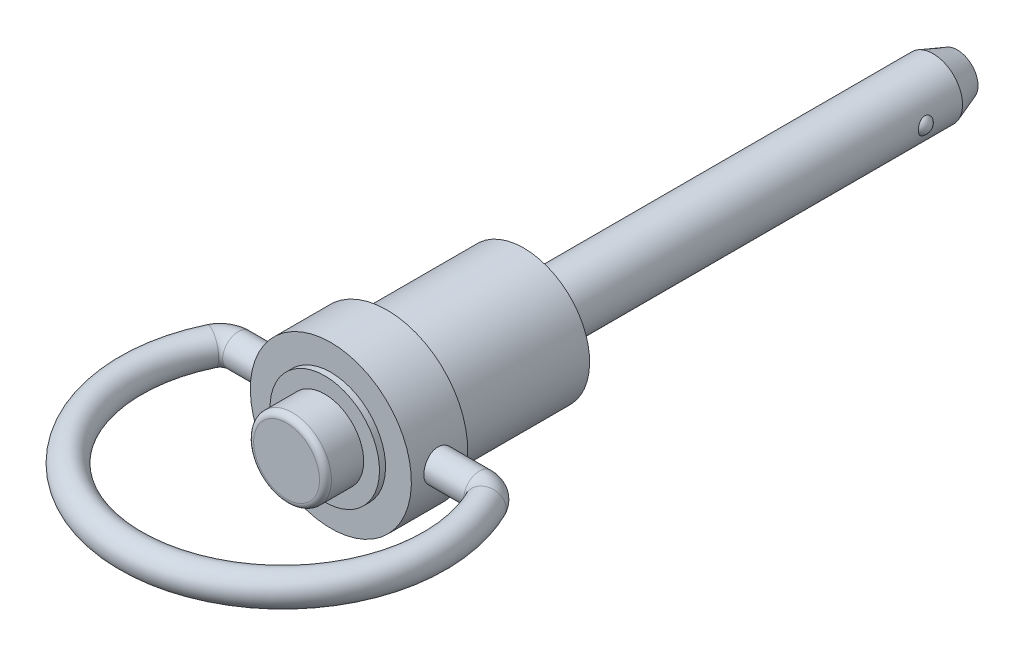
ISO-10303-21;
HEADER;
FILE_DESCRIPTION(('STEP AP214'),'2;1');
FILE_NAME('part.step','',(''),(''),'','','');
FILE_SCHEMA(('AUTOMOTIVE_DESIGN { 1 0 10303 214 1 1 1 1 }'));
ENDSEC;
DATA;
#1=APPLICATION_CONTEXT('core data for automotive mechanical design processes');
#2=APPLICATION_PROTOCOL_DEFINITION('international standard','automotive_design',2000,#1);
#3=PRODUCT_CONTEXT('',#1,'mechanical');
#4=PRODUCT('Part','Part','',(#3));
#5=PRODUCT_RELATED_PRODUCT_CATEGORY('part','',(#4));
#6=PRODUCT_DEFINITION_FORMATION('','',#4);
#7=PRODUCT_DEFINITION_CONTEXT('part definition',#1,'design');
#8=PRODUCT_DEFINITION('design','',#6,#7);
#9=PRODUCT_DEFINITION_SHAPE('','',#8);
#10=(LENGTH_UNIT() NAMED_UNIT(*) SI_UNIT(.MILLI.,.METRE.));
#11=(NAMED_UNIT(*) PLANE_ANGLE_UNIT() SI_UNIT($,.RADIAN.));
#12=(NAMED_UNIT(*) SI_UNIT($,.STERADIAN.) SOLID_ANGLE_UNIT());
#13=UNCERTAINTY_MEASURE_WITH_UNIT(LENGTH_MEASURE(1.E-05),#10,'distance_accuracy_value','');
#14=(GEOMETRIC_REPRESENTATION_CONTEXT(3) GLOBAL_UNCERTAINTY_ASSIGNED_CONTEXT((#13)) GLOBAL_UNIT_ASSIGNED_CONTEXT((#10,
#11,#12)) REPRESENTATION_CONTEXT('',''));
#15=CARTESIAN_POINT('',(0.,0.,0.));
#16=DIRECTION('',(0.,0.,1.));
#17=DIRECTION('',(1.,0.,0.));
#18=AXIS2_PLACEMENT_3D('',#15,#16,#17);
#19=CARTESIAN_POINT('',(0.,0.,20.828));
#20=DIRECTION('',(0.,0.,-1.));
#21=DIRECTION('',(0.,1.,0.));
#22=AXIS2_PLACEMENT_3D('',#19,#20,#21);
#23=CYLINDRICAL_SURFACE('',#22,3.2512);
#24=CARTESIAN_POINT('',(0.,0.,16.637));
#25=DIRECTION('',(0.,0.,-1.));
#26=DIRECTION('',(0.,1.,0.));
#27=AXIS2_PLACEMENT_3D('',#24,#25,#26);
#28=CIRCLE('',#27,3.2512);
#29=CARTESIAN_POINT('',(0.,3.2512,16.637));
#30=VERTEX_POINT('',#29);
#31=EDGE_CURVE('E35',#30,#30,#28,.T.);
#32=ORIENTED_EDGE('',*,*,#31,.F.);
#33=EDGE_LOOP('',(#32));
#34=FACE_BOUND('',#33,.T.);
#35=CARTESIAN_POINT('',(0.,0.,19.328));
#36=DIRECTION('',(0.,0.,1.));
#37=DIRECTION('',(1.,0.,0.));
#38=AXIS2_PLACEMENT_3D('',#35,#36,#37);
#39=CIRCLE('',#38,3.2512);
#40=CARTESIAN_POINT('',(3.2512,0.,19.328));
#41=VERTEX_POINT('',#40);
#42=EDGE_CURVE('E157',#41,#41,#39,.T.);
#43=ORIENTED_EDGE('',*,*,#42,.F.);
#44=EDGE_LOOP('',(#43));
#45=FACE_BOUND('',#44,.T.);
#46=ADVANCED_FACE('F13',(#34,#45),#23,.T.);
#47=CARTESIAN_POINT('',(4.572,0.,16.637));
#48=DIRECTION('',(0.,0.,1.));
#49=DIRECTION('',(0.,-1.,0.));
#50=AXIS2_PLACEMENT_3D('',#47,#48,#49);
#51=PLANE('',#50);
#52=ORIENTED_EDGE('',*,*,#31,.T.);
#53=EDGE_LOOP('',(#52));
#54=FACE_BOUND('',#53,.T.);
#55=CARTESIAN_POINT('',(0.,0.,16.637));
#56=DIRECTION('',(0.,0.,-1.));
#57=DIRECTION('',(0.,1.,0.));
#58=AXIS2_PLACEMENT_3D('',#55,#56,#57);
#59=CIRCLE('',#58,4.572);
#60=CARTESIAN_POINT('',(0.,4.572,16.637));
#61=VERTEX_POINT('',#60);
#62=EDGE_CURVE('E40',#61,#61,#59,.T.);
#63=ORIENTED_EDGE('',*,*,#62,.F.);
#64=EDGE_LOOP('',(#63));
#65=FACE_BOUND('',#64,.T.);
#66=ADVANCED_FACE('F81',(#54,#65),#51,.T.);
#67=CARTESIAN_POINT('',(0.,0.,0.));
#68=DIRECTION('',(0.,0.,-1.));
#69=DIRECTION('',(0.,1.,0.));
#70=AXIS2_PLACEMENT_3D('',#67,#68,#69);
#71=CYLINDRICAL_SURFACE('',#70,4.572);
#72=ORIENTED_EDGE('',*,*,#62,.T.);
#73=EDGE_LOOP('',(#72));
#74=FACE_BOUND('',#73,.T.);
#75=CARTESIAN_POINT('',(0.,0.,16.129));
#76=DIRECTION('',(0.,0.,-1.));
#77=DIRECTION('',(0.,1.,0.));
#78=AXIS2_PLACEMENT_3D('',#75,#76,#77);
#79=CIRCLE('',#78,4.572);
#80=CARTESIAN_POINT('',(0.,4.572,16.129));
#81=VERTEX_POINT('',#80);
#82=EDGE_CURVE('E43',#81,#81,#79,.T.);
#83=ORIENTED_EDGE('',*,*,#82,.F.);
#84=EDGE_LOOP('',(#83));
#85=FACE_BOUND('',#84,.T.);
#86=ADVANCED_FACE('F151',(#74,#85),#71,.T.);
#87=CARTESIAN_POINT('',(6.731,0.,16.129));
#88=DIRECTION('',(0.,0.,1.));
#89=DIRECTION('',(0.,-1.,0.));
#90=AXIS2_PLACEMENT_3D('',#87,#88,#89);
#91=PLANE('',#90);
#92=CARTESIAN_POINT('',(0.,0.,16.129));
#93=DIRECTION('',(0.,0.,-1.));
#94=DIRECTION('',(0.,1.,0.));
#95=AXIS2_PLACEMENT_3D('',#92,#93,#94);
#96=CIRCLE('',#95,6.731);
#97=CARTESIAN_POINT('',(0.,6.731,16.129));
#98=VERTEX_POINT('',#97);
#99=EDGE_CURVE('E46',#98,#98,#96,.T.);
#100=ORIENTED_EDGE('',*,*,#99,.F.);
#101=EDGE_LOOP('',(#100));
#102=FACE_BOUND('',#101,.T.);
#103=ORIENTED_EDGE('',*,*,#82,.T.);
#104=EDGE_LOOP('',(#103));
#105=FACE_BOUND('',#104,.T.);
#106=ADVANCED_FACE('F193',(#102,#105),#91,.T.);
#107=CARTESIAN_POINT('',(0.,0.,0.));
#108=DIRECTION('',(0.,0.,-1.));
#109=DIRECTION('',(0.,1.,0.));
#110=AXIS2_PLACEMENT_3D('',#107,#108,#109);
#111=CYLINDRICAL_SURFACE('',#110,6.731);
#112=CARTESIAN_POINT('',(0.,0.,11.43));
#113=DIRECTION('',(0.,0.,-1.));
#114=DIRECTION('',(0.,1.,0.));
#115=AXIS2_PLACEMENT_3D('',#112,#113,#114);
#116=CIRCLE('',#115,6.731);
#117=CARTESIAN_POINT('',(0.,6.731,11.43));
#118=VERTEX_POINT('',#117);
#119=EDGE_CURVE('E34',#118,#118,#116,.T.);
#120=ORIENTED_EDGE('',*,*,#119,.F.);
#121=EDGE_LOOP('',(#120));
#122=FACE_BOUND('',#121,.T.);
#123=ORIENTED_EDGE('',*,*,#99,.T.);
#124=EDGE_LOOP('',(#123));
#125=FACE_BOUND('',#124,.T.);
#126=CARTESIAN_POINT('',(-6.6051722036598,1.2954,13.7922));
#127=CARTESIAN_POINT('',(-6.60517361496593,1.2953972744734,13.864236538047));
#128=CARTESIAN_POINT('',(-6.60636346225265,1.28937073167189,13.9363080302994));
#129=CARTESIAN_POINT('',(-6.61098794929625,1.26544153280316,14.0784162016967));
#130=CARTESIAN_POINT('',(-6.61442445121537,1.24752902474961,14.1484511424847));
#131=CARTESIAN_POINT('',(-6.62313895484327,1.20040052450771,14.2844095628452));
#132=CARTESIAN_POINT('',(-6.62841519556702,1.17119533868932,14.3503369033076));
#133=CARTESIAN_POINT('',(-6.64021258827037,1.10233951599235,14.4763528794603));
#134=CARTESIAN_POINT('',(-6.64673365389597,1.06268960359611,14.5364419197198));
#135=CARTESIAN_POINT('',(-6.66038139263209,0.973516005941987,14.6498669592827));
#136=CARTESIAN_POINT('',(-6.66751428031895,0.9238817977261,14.7031153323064));
#137=CARTESIAN_POINT('',(-6.68152715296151,0.816387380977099,14.8005834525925));
#138=CARTESIAN_POINT('',(-6.6884071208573,0.758526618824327,14.8448025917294));
#139=CARTESIAN_POINT('',(-6.7012057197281,0.635644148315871,14.9232944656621));
#140=CARTESIAN_POINT('',(-6.70711617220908,0.570568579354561,14.9574843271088));
#141=CARTESIAN_POINT('',(-6.71724013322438,0.435464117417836,15.014412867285));
#142=CARTESIAN_POINT('',(-6.72145378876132,0.365435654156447,15.0371525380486));
#143=CARTESIAN_POINT('',(-6.72766549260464,0.223321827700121,15.0702635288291));
#144=CARTESIAN_POINT('',(-6.72968999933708,0.151272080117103,15.0807826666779));
#145=CARTESIAN_POINT('',(-6.73138656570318,0.00640388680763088,15.089614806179));
#146=CARTESIAN_POINT('',(-6.73105883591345,-0.0664144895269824,15.0879289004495));
#147=CARTESIAN_POINT('',(-6.72810846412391,-0.209738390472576,15.072511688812));
#148=CARTESIAN_POINT('',(-6.72551615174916,-0.280261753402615,15.0589395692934));
#149=CARTESIAN_POINT('',(-6.71836197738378,-0.418011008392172,15.0203872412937));
#150=CARTESIAN_POINT('',(-6.71380004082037,-0.485236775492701,14.9954066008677));
#151=CARTESIAN_POINT('',(-6.70316878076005,-0.614941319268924,14.9345963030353));
#152=CARTESIAN_POINT('',(-6.69709072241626,-0.67738974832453,14.8987035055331));
#153=CARTESIAN_POINT('',(-6.68409856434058,-0.795436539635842,14.8171343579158));
#154=CARTESIAN_POINT('',(-6.677184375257,-0.851034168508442,14.7714569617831));
#155=CARTESIAN_POINT('',(-6.66315320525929,-0.954744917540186,14.6707395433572));
#156=CARTESIAN_POINT('',(-6.65603475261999,-1.00272266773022,14.6155602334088));
#157=CARTESIAN_POINT('',(-6.64250376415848,-1.08876420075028,14.4978679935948));
#158=CARTESIAN_POINT('',(-6.63609123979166,-1.12682782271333,14.4353549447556));
#159=CARTESIAN_POINT('',(-6.62469571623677,-1.19200234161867,14.3045844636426));
#160=CARTESIAN_POINT('',(-6.61971540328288,-1.21909269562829,14.2363165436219));
#161=CARTESIAN_POINT('',(-6.61178862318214,-1.26138008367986,14.0960804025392));
#162=CARTESIAN_POINT('',(-6.60884191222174,-1.27657854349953,14.0241126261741));
#163=CARTESIAN_POINT('',(-6.60536444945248,-1.29445125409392,13.8797427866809));
#164=CARTESIAN_POINT('',(-6.60479610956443,-1.29732037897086,13.8073657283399));
#165=CARTESIAN_POINT('',(-6.60603903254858,-1.29097613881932,13.6631669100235));
#166=CARTESIAN_POINT('',(-6.60785017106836,-1.28176340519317,13.5913451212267));
#167=CARTESIAN_POINT('',(-6.6136128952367,-1.25168453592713,13.4509418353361));
#168=CARTESIAN_POINT('',(-6.61754556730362,-1.23092132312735,13.3823374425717));
#169=CARTESIAN_POINT('',(-6.62709183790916,-1.17844042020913,13.249581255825));
#170=CARTESIAN_POINT('',(-6.63270556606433,-1.14672188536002,13.1854298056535));
#171=CARTESIAN_POINT('',(-6.6450665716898,-1.07278507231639,13.0625442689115));
#172=CARTESIAN_POINT('',(-6.65182676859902,-1.03044414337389,13.0038853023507));
#173=CARTESIAN_POINT('',(-6.66568301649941,-0.936629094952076,12.8944341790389));
#174=CARTESIAN_POINT('',(-6.67277909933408,-0.885154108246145,12.8436427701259));
#175=CARTESIAN_POINT('',(-6.68662882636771,-0.773660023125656,12.7506362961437));
#176=CARTESIAN_POINT('',(-6.69337621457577,-0.713530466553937,12.7085525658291));
#177=CARTESIAN_POINT('',(-6.70566168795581,-0.586941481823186,12.6350847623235));
#178=CARTESIAN_POINT('',(-6.71119982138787,-0.520482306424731,12.6037002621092));
#179=CARTESIAN_POINT('',(-6.72041595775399,-0.383476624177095,12.5527164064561));
#180=CARTESIAN_POINT('',(-6.72410395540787,-0.312954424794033,12.5330536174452));
#181=CARTESIAN_POINT('',(-6.72924701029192,-0.169530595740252,12.5058694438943));
#182=CARTESIAN_POINT('',(-6.7307023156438,-0.0966292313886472,12.4983467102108));
#183=CARTESIAN_POINT('',(-6.73121071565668,0.0482259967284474,12.4957052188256));
#184=CARTESIAN_POINT('',(-6.73030215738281,0.120176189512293,12.5003884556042));
#185=CARTESIAN_POINT('',(-6.72626496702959,0.26224403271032,12.5215909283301));
#186=CARTESIAN_POINT('',(-6.72313635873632,0.332361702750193,12.5381100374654));
#187=CARTESIAN_POINT('',(-6.71501101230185,0.468662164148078,12.5824301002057));
#188=CARTESIAN_POINT('',(-6.710017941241,0.534852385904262,12.6102089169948));
#189=CARTESIAN_POINT('',(-6.69870305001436,0.661661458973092,12.6762356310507));
#190=CARTESIAN_POINT('',(-6.69238113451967,0.722279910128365,12.7144842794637));
#191=CARTESIAN_POINT('',(-6.6789853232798,0.837208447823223,12.8010411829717));
#192=CARTESIAN_POINT('',(-6.67190155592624,0.891410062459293,12.8494919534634));
#193=CARTESIAN_POINT('',(-6.65784127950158,0.990982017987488,12.95478313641));
#194=CARTESIAN_POINT('',(-6.65086479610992,1.03635027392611,13.0116255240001));
#195=CARTESIAN_POINT('',(-6.63773378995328,1.11738877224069,13.1327559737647));
#196=CARTESIAN_POINT('',(-6.63158802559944,1.15295925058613,13.1971117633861));
#197=CARTESIAN_POINT('',(-6.62092027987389,1.21272619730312,13.3309847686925));
#198=CARTESIAN_POINT('',(-6.61639678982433,1.23693323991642,13.4004971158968));
#199=CARTESIAN_POINT('',(-6.61041337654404,1.26845390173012,13.5238636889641));
#200=CARTESIAN_POINT('',(-6.60845980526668,1.27854107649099,13.57700269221));
#201=CARTESIAN_POINT('',(-6.60583870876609,1.29201504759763,13.6841545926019));
#202=CARTESIAN_POINT('',(-6.60517114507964,1.29540204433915,13.7381674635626));
#203=CARTESIAN_POINT('',(-6.6051722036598,1.2954,13.7922));
#204=B_SPLINE_CURVE_WITH_KNOTS('',3,(#126,#127,#128,#129,#130,#131,#132,#133,#134,#135,#136,
#137,#138,#139,#140,#141,#142,#143,#144,#145,#146,#147,#148,#149,#150,#151,#152,#153,#154,#155,
#156,#157,#158,#159,#160,#161,#162,#163,#164,#165,#166,#167,#168,#169,#170,#171,#172,#173,#174,
#175,#176,#177,#178,#179,#180,#181,#182,#183,#184,#185,#186,#187,#188,#189,#190,#191,#192,#193,
#194,#195,#196,#197,#198,#199,#200,#201,#202,#203),.UNSPECIFIED.,.T.,.F.,(4,2,2,2,2,2,2,2,2,2,2,
2,2,2,2,2,2,2,2,2,2,2,2,2,2,2,2,2,2,2,2,2,2,2,2,2,2,2,4),(0.,0.215911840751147,
0.432002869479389,0.64788762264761,0.86375740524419,1.08216318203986,1.30058366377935,
1.52076118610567,1.74091962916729,1.95838638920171,2.1758336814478,2.39041258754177,
2.60499961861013,2.82085272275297,3.0367289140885,3.25609136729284,3.47545737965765,
3.69523218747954,3.91498064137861,4.13124273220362,4.34749352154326,4.56184753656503,
4.7762180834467,4.99318797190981,5.21017847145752,5.430235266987,5.65028327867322,
5.86912939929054,6.08795119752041,6.30324544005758,6.51853737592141,6.73340808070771,
6.94829420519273,7.16640910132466,7.38457541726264,7.60488731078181,7.82499378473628,
7.9869478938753,8.14889715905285),.UNSPECIFIED.);
#205=CARTESIAN_POINT('',(-6.6051722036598,1.2954,13.7922));
#206=VERTEX_POINT('',#205);
#207=EDGE_CURVE('E28',#206,#206,#204,.T.);
#208=ORIENTED_EDGE('',*,*,#207,.T.);
#209=EDGE_LOOP('',(#208));
#210=FACE_BOUND('',#209,.T.);
#211=CARTESIAN_POINT('',(6.6051722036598,1.2954,13.7922));
#212=CARTESIAN_POINT('',(6.60517361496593,1.2953972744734,13.720163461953));
#213=CARTESIAN_POINT('',(6.60636346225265,1.2893707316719,13.6480919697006));
#214=CARTESIAN_POINT('',(6.61098794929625,1.26544153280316,13.5059837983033));
#215=CARTESIAN_POINT('',(6.61442445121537,1.24752902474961,13.4359488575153));
#216=CARTESIAN_POINT('',(6.62313895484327,1.20040052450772,13.2999904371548));
#217=CARTESIAN_POINT('',(6.62841519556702,1.17119533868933,13.2340630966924));
#218=CARTESIAN_POINT('',(6.64021258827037,1.10233951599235,13.1080471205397));
#219=CARTESIAN_POINT('',(6.64673365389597,1.06268960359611,13.0479580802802));
#220=CARTESIAN_POINT('',(6.66038139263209,0.973516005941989,12.9345330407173));
#221=CARTESIAN_POINT('',(6.66751428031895,0.923881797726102,12.8812846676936));
#222=CARTESIAN_POINT('',(6.68152715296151,0.816387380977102,12.7838165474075));
#223=CARTESIAN_POINT('',(6.6884071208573,0.758526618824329,12.7395974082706));
#224=CARTESIAN_POINT('',(6.7012057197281,0.635644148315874,12.6611055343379));
#225=CARTESIAN_POINT('',(6.70711617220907,0.570568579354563,12.6269156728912));
#226=CARTESIAN_POINT('',(6.71724013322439,0.435464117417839,12.569987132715));
#227=CARTESIAN_POINT('',(6.72145378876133,0.36543565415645,12.5472474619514));
#228=CARTESIAN_POINT('',(6.72766549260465,0.223321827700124,12.5141364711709));
#229=CARTESIAN_POINT('',(6.72968999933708,0.151272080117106,12.5036173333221));
#230=CARTESIAN_POINT('',(6.73138656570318,0.00640388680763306,12.494785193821));
#231=CARTESIAN_POINT('',(6.73105883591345,-0.0664144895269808,12.4964710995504));
#232=CARTESIAN_POINT('',(6.72810846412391,-0.209738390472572,12.511888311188));
#233=CARTESIAN_POINT('',(6.72551615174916,-0.280261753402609,12.5254604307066));
#234=CARTESIAN_POINT('',(6.71836197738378,-0.418011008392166,12.5640127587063));
#235=CARTESIAN_POINT('',(6.71380004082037,-0.4852367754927,12.5889933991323));
#236=CARTESIAN_POINT('',(6.70316878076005,-0.614941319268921,12.6498036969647));
#237=CARTESIAN_POINT('',(6.69709072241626,-0.67738974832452,12.6856964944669));
#238=CARTESIAN_POINT('',(6.68409856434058,-0.795436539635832,12.7672656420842));
#239=CARTESIAN_POINT('',(6.677184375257,-0.851034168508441,12.8129430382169));
#240=CARTESIAN_POINT('',(6.66315320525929,-0.954744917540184,12.9136604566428));
#241=CARTESIAN_POINT('',(6.65603475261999,-1.00272266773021,12.9688397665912));
#242=CARTESIAN_POINT('',(6.64250376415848,-1.08876420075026,13.0865320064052));
#243=CARTESIAN_POINT('',(6.63609123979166,-1.12682782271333,13.1490450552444));
#244=CARTESIAN_POINT('',(6.62469571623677,-1.19200234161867,13.2798155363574));
#245=CARTESIAN_POINT('',(6.61971540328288,-1.21909269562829,13.3480834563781));
#246=CARTESIAN_POINT('',(6.61178862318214,-1.26138008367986,13.4883195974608));
#247=CARTESIAN_POINT('',(6.60884191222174,-1.27657854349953,13.5602873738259));
#248=CARTESIAN_POINT('',(6.60536444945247,-1.29445125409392,13.7046572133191));
#249=CARTESIAN_POINT('',(6.60479610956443,-1.29732037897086,13.7770342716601));
#250=CARTESIAN_POINT('',(6.60603903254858,-1.29097613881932,13.9212330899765));
#251=CARTESIAN_POINT('',(6.60785017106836,-1.28176340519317,13.9930548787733));
#252=CARTESIAN_POINT('',(6.6136128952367,-1.25168453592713,14.1334581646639));
#253=CARTESIAN_POINT('',(6.61754556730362,-1.23092132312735,14.2020625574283));
#254=CARTESIAN_POINT('',(6.62709183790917,-1.17844042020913,14.334818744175));
#255=CARTESIAN_POINT('',(6.63270556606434,-1.14672188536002,14.3989701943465));
#256=CARTESIAN_POINT('',(6.64506657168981,-1.07278507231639,14.5218557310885));
#257=CARTESIAN_POINT('',(6.65182676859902,-1.03044414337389,14.5805146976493));
#258=CARTESIAN_POINT('',(6.66568301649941,-0.936629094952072,14.6899658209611));
#259=CARTESIAN_POINT('',(6.67277909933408,-0.885154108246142,14.7407572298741));
#260=CARTESIAN_POINT('',(6.68662882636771,-0.773660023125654,14.8337637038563));
#261=CARTESIAN_POINT('',(6.69337621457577,-0.713530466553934,14.8758474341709));
#262=CARTESIAN_POINT('',(6.70566168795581,-0.586941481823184,14.9493152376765));
#263=CARTESIAN_POINT('',(6.71119982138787,-0.520482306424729,14.9806997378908));
#264=CARTESIAN_POINT('',(6.72041595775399,-0.383476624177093,15.0316835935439));
#265=CARTESIAN_POINT('',(6.72410395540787,-0.31295442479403,15.0513463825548));
#266=CARTESIAN_POINT('',(6.72924701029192,-0.169530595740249,15.0785305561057));
#267=CARTESIAN_POINT('',(6.7307023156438,-0.0966292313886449,15.0860532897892));
#268=CARTESIAN_POINT('',(6.73121071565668,0.0482259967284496,15.0886947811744));
#269=CARTESIAN_POINT('',(6.73030215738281,0.120176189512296,15.0840115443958));
#270=CARTESIAN_POINT('',(6.72626496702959,0.262244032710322,15.0628090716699));
#271=CARTESIAN_POINT('',(6.72313635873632,0.332361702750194,15.0462899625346));
#272=CARTESIAN_POINT('',(6.71501101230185,0.46866216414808,15.0019698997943));
#273=CARTESIAN_POINT('',(6.710017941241,0.534852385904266,14.9741910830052));
#274=CARTESIAN_POINT('',(6.69870305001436,0.661661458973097,14.9081643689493));
#275=CARTESIAN_POINT('',(6.69238113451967,0.722279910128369,14.8699157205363));
#276=CARTESIAN_POINT('',(6.6789853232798,0.837208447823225,14.7833588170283));
#277=CARTESIAN_POINT('',(6.67190155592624,0.891410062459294,14.7349080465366));
#278=CARTESIAN_POINT('',(6.65784127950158,0.990982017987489,14.62961686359));
#279=CARTESIAN_POINT('',(6.65086479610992,1.03635027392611,14.5727744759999));
#280=CARTESIAN_POINT('',(6.63773378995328,1.1173887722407,14.4516440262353));
#281=CARTESIAN_POINT('',(6.63158802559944,1.15295925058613,14.3872882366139));
#282=CARTESIAN_POINT('',(6.62092027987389,1.21272619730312,14.2534152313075));
#283=CARTESIAN_POINT('',(6.61639678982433,1.23693323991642,14.1839028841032));
#284=CARTESIAN_POINT('',(6.61041337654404,1.26845390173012,14.0605363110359));
#285=CARTESIAN_POINT('',(6.60845980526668,1.27854107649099,14.00739730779));
#286=CARTESIAN_POINT('',(6.60583870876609,1.29201504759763,13.9002454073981));
#287=CARTESIAN_POINT('',(6.60517114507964,1.29540204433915,13.8462325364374));
#288=CARTESIAN_POINT('',(6.6051722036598,1.2954,13.7922));
#289=B_SPLINE_CURVE_WITH_KNOTS('',3,(#211,#212,#213,#214,#215,#216,#217,#218,#219,#220,#221,
#222,#223,#224,#225,#226,#227,#228,#229,#230,#231,#232,#233,#234,#235,#236,#237,#238,#239,#240,
#241,#242,#243,#244,#245,#246,#247,#248,#249,#250,#251,#252,#253,#254,#255,#256,#257,#258,#259,
#260,#261,#262,#263,#264,#265,#266,#267,#268,#269,#270,#271,#272,#273,#274,#275,#276,#277,#278,
#279,#280,#281,#282,#283,#284,#285,#286,#287,#288),.UNSPECIFIED.,.T.,.F.,(4,2,2,2,2,2,2,2,2,2,2,
2,2,2,2,2,2,2,2,2,2,2,2,2,2,2,2,2,2,2,2,2,2,2,2,2,2,2,4),(0.,0.215911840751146,
0.432002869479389,0.64788762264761,0.86375740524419,1.08216318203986,1.30058366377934,
1.52076118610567,1.74091962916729,1.95838638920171,2.1758336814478,2.39041258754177,
2.60499961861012,2.82085272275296,3.0367289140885,3.25609136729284,3.47545737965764,
3.69523218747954,3.91498064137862,4.13124273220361,4.34749352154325,4.56184753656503,
4.77621808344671,4.99318797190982,5.21017847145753,5.43023526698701,5.65028327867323,
5.86912939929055,6.08795119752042,6.30324544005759,6.51853737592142,6.73340808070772,
6.94829420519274,7.16640910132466,7.38457541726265,7.60488731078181,7.82499378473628,
7.98694789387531,8.14889715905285),.UNSPECIFIED.);
#290=CARTESIAN_POINT('',(6.6051722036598,1.2954,13.7922));
#291=VERTEX_POINT('',#290);
#292=EDGE_CURVE('E24',#291,#291,#289,.T.);
#293=ORIENTED_EDGE('',*,*,#292,.T.);
#294=EDGE_LOOP('',(#293));
#295=FACE_BOUND('',#294,.T.);
#296=ADVANCED_FACE('F143',(#122,#125,#210,#295),#111,.T.);
#297=CARTESIAN_POINT('',(5.7785,0.,11.43));
#298=DIRECTION('',(0.,0.,-1.));
#299=DIRECTION('',(0.,1.,0.));
#300=AXIS2_PLACEMENT_3D('',#297,#298,#299);
#301=PLANE('',#300);
#302=CARTESIAN_POINT('',(0.,0.,11.43));
#303=DIRECTION('',(0.,0.,-1.));
#304=DIRECTION('',(0.,1.,0.));
#305=AXIS2_PLACEMENT_3D('',#302,#303,#304);
#306=CIRCLE('',#305,5.9);
#307=CARTESIAN_POINT('',(0.,5.9,11.43));
#308=VERTEX_POINT('',#307);
#309=EDGE_CURVE('E20',#308,#308,#306,.F.);
#310=ORIENTED_EDGE('',*,*,#309,.T.);
#311=EDGE_LOOP('',(#310));
#312=FACE_BOUND('',#311,.T.);
#313=ORIENTED_EDGE('',*,*,#119,.T.);
#314=EDGE_LOOP('',(#313));
#315=FACE_BOUND('',#314,.T.);
#316=ADVANCED_FACE('F137',(#312,#315),#301,.T.);
#317=CARTESIAN_POINT('',(10.0803124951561,0.,15.3162));
#318=DIRECTION('',(0.,1.,0.));
#319=DIRECTION('',(-1.,0.,0.));
#320=AXIS2_PLACEMENT_3D('',#317,#318,#319);
#321=TOROIDAL_SURFACE('',#320,1.524,1.2954);
#322=CARTESIAN_POINT('',(11.4549005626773,0.,14.658109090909));
#323=DIRECTION('',(-0.431818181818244,0.,-0.901960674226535));
#324=DIRECTION('',(0.901960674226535,0.,-0.431818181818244));
#325=AXIS2_PLACEMENT_3D('',#322,#323,#324);
#326=CIRCLE('',#325,1.2954);
#327=CARTESIAN_POINT('',(12.6233004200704,0.,14.0987318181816));
#328=VERTEX_POINT('',#327);
#329=EDGE_CURVE('E51',#328,#328,#326,.T.);
#330=ORIENTED_EDGE('',*,*,#329,.T.);
#331=EDGE_LOOP('',(#330));
#332=FACE_BOUND('',#331,.T.);
#333=CARTESIAN_POINT('',(10.0803124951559,0.,13.7922));
#334=DIRECTION('',(1.,0.,0.));
#335=DIRECTION('',(0.,1.,0.));
#336=AXIS2_PLACEMENT_3D('',#333,#334,#335);
#337=CIRCLE('',#336,1.2954);
#338=CARTESIAN_POINT('',(10.0803124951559,1.2954,13.7922));
#339=VERTEX_POINT('',#338);
#340=EDGE_CURVE('E39',#339,#339,#337,.F.);
#341=ORIENTED_EDGE('',*,*,#340,.F.);
#342=EDGE_LOOP('',(#341));
#343=FACE_BOUND('',#342,.T.);
#344=ADVANCED_FACE('F79',(#332,#343),#321,.T.);
#345=CARTESIAN_POINT('',(-10.0803124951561,0.,13.7922));
#346=DIRECTION('',(1.,0.,0.));
#347=DIRECTION('',(0.,1.,0.));
#348=AXIS2_PLACEMENT_3D('',#345,#346,#347);
#349=CYLINDRICAL_SURFACE('',#348,1.2954);
#350=ORIENTED_EDGE('',*,*,#292,.F.);
#351=EDGE_LOOP('',(#350));
#352=FACE_BOUND('',#351,.T.);
#353=ORIENTED_EDGE('',*,*,#340,.T.);
#354=EDGE_LOOP('',(#353));
#355=FACE_BOUND('',#354,.T.);
#356=ADVANCED_FACE('F75',(#352,#355),#349,.T.);
#357=CARTESIAN_POINT('',(0.,0.,20.1422));
#358=DIRECTION('',(0.,1.,0.));
#359=DIRECTION('',(-1.,0.,0.));
#360=AXIS2_PLACEMENT_3D('',#357,#358,#359);
#361=TOROIDAL_SURFACE('',#360,12.7,1.2954);
#362=CARTESIAN_POINT('',(-11.4549005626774,0.,14.6581090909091));
#363=DIRECTION('',(-0.43181818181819,0.,0.901960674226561));
#364=DIRECTION('',(-0.901960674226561,0.,-0.43181818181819));
#365=AXIS2_PLACEMENT_3D('',#362,#363,#364);
#366=CIRCLE('',#365,1.2954);
#367=CARTESIAN_POINT('',(-12.6233004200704,0.,14.0987318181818));
#368=VERTEX_POINT('',#367);
#369=EDGE_CURVE('E54',#368,#368,#366,.F.);
#370=ORIENTED_EDGE('',*,*,#369,.F.);
#371=EDGE_LOOP('',(#370));
#372=FACE_BOUND('',#371,.T.);
#373=ORIENTED_EDGE('',*,*,#329,.F.);
#374=EDGE_LOOP('',(#373));
#375=FACE_BOUND('',#374,.T.);
#376=ADVANCED_FACE('F72',(#372,#375),#361,.T.);
#377=CARTESIAN_POINT('',(-10.0803124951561,0.,15.3162));
#378=DIRECTION('',(0.,1.,0.));
#379=DIRECTION('',(-1.,0.,0.));
#380=AXIS2_PLACEMENT_3D('',#377,#378,#379);
#381=TOROIDAL_SURFACE('',#380,1.524,1.2954);
#382=CARTESIAN_POINT('',(-10.0803124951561,0.,13.7922));
#383=DIRECTION('',(1.,0.,0.));
#384=DIRECTION('',(0.,1.,0.));
#385=AXIS2_PLACEMENT_3D('',#382,#383,#384);
#386=CIRCLE('',#385,1.2954);
#387=CARTESIAN_POINT('',(-10.0803124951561,1.2954,13.7922));
#388=VERTEX_POINT('',#387);
#389=EDGE_CURVE('E38',#388,#388,#386,.T.);
#390=ORIENTED_EDGE('',*,*,#389,.F.);
#391=EDGE_LOOP('',(#390));
#392=FACE_BOUND('',#391,.T.);
#393=ORIENTED_EDGE('',*,*,#369,.T.);
#394=EDGE_LOOP('',(#393));
#395=FACE_BOUND('',#394,.T.);
#396=ADVANCED_FACE('F67',(#392,#395),#381,.T.);
#397=CARTESIAN_POINT('',(-10.0803124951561,0.,13.7922));
#398=DIRECTION('',(1.,0.,0.));
#399=DIRECTION('',(0.,1.,0.));
#400=AXIS2_PLACEMENT_3D('',#397,#398,#399);
#401=CYLINDRICAL_SURFACE('',#400,1.2954);
#402=ORIENTED_EDGE('',*,*,#207,.F.);
#403=EDGE_LOOP('',(#402));
#404=FACE_BOUND('',#403,.T.);
#405=ORIENTED_EDGE('',*,*,#389,.T.);
#406=EDGE_LOOP('',(#405));
#407=FACE_BOUND('',#406,.T.);
#408=ADVANCED_FACE('F71',(#404,#407),#401,.T.);
#409=CARTESIAN_POINT('',(0.,0.,19.828));
#410=DIRECTION('',(0.,0.,-1.));
#411=DIRECTION('',(-1.,0.,0.));
#412=AXIS2_PLACEMENT_3D('',#409,#410,#411);
#413=PLANE('',#412);
#414=CARTESIAN_POINT('',(0.,0.,19.828));
#415=DIRECTION('',(0.,0.,1.));
#416=DIRECTION('',(1.,0.,0.));
#417=AXIS2_PLACEMENT_3D('',#414,#415,#416);
#418=CIRCLE('',#417,2.7512);
#419=CARTESIAN_POINT('',(2.7512,0.,19.828));
#420=VERTEX_POINT('',#419);
#421=EDGE_CURVE('E159',#420,#420,#418,.T.);
#422=ORIENTED_EDGE('',*,*,#421,.T.);
#423=EDGE_LOOP('',(#422));
#424=FACE_BOUND('',#423,.T.);
#425=ADVANCED_FACE('F98',(#424),#413,.F.);
#426=CARTESIAN_POINT('',(0.,0.,19.328));
#427=DIRECTION('',(0.,0.,1.));
#428=DIRECTION('',(1.,0.,0.));
#429=AXIS2_PLACEMENT_3D('',#426,#427,#428);
#430=TOROIDAL_SURFACE('',#429,2.7512,0.5);
#431=ORIENTED_EDGE('',*,*,#421,.F.);
#432=EDGE_LOOP('',(#431));
#433=FACE_BOUND('',#432,.T.);
#434=ORIENTED_EDGE('',*,*,#42,.T.);
#435=EDGE_LOOP('',(#434));
#436=FACE_BOUND('',#435,.T.);
#437=ADVANCED_FACE('F170',(#433,#436),#430,.T.);
#438=CARTESIAN_POINT('',(0.,0.,40.0063262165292));
#439=DIRECTION('',(0.,0.,-1.));
#440=DIRECTION('',(0.,1.,0.));
#441=AXIS2_PLACEMENT_3D('',#438,#439,#440);
#442=CYLINDRICAL_SURFACE('',#441,5.5);
#443=CARTESIAN_POINT('',(0.,0.,11.03));
#444=DIRECTION('',(0.,0.,-1.));
#445=DIRECTION('',(0.,1.,0.));
#446=AXIS2_PLACEMENT_3D('',#443,#444,#445);
#447=CIRCLE('',#446,5.5);
#448=CARTESIAN_POINT('',(0.,5.5,11.03));
#449=VERTEX_POINT('',#448);
#450=EDGE_CURVE('E8',#449,#449,#447,.T.);
#451=ORIENTED_EDGE('',*,*,#450,.T.);
#452=EDGE_LOOP('',(#451));
#453=FACE_BOUND('',#452,.T.);
#454=CARTESIAN_POINT('',(0.,0.,0.));
#455=DIRECTION('',(0.,0.,-1.));
#456=DIRECTION('',(0.,1.,0.));
#457=AXIS2_PLACEMENT_3D('',#454,#455,#456);
#458=CIRCLE('',#457,5.5);
#459=CARTESIAN_POINT('',(0.,5.5,0.));
#460=VERTEX_POINT('',#459);
#461=EDGE_CURVE('E160',#460,#460,#458,.T.);
#462=ORIENTED_EDGE('',*,*,#461,.F.);
#463=EDGE_LOOP('',(#462));
#464=FACE_BOUND('',#463,.T.);
#465=ADVANCED_FACE('F105',(#453,#464),#442,.T.);
#466=CARTESIAN_POINT('',(1.73119748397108,0.,-36.2306));
#467=DIRECTION('',(0.,0.,1.));
#468=DIRECTION('',(0.,-1.,0.));
#469=AXIS2_PLACEMENT_3D('',#466,#467,#468);
#470=PLANE('',#469);
#471=CARTESIAN_POINT('',(0.,0.,-36.2306000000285));
#472=DIRECTION('',(0.,0.,1.));
#473=DIRECTION('',(-1.,0.,0.));
#474=AXIS2_PLACEMENT_3D('',#471,#472,#473);
#475=CIRCLE('',#474,1.73119748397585);
#476=CARTESIAN_POINT('',(-1.73119748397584,0.,-36.2306000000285));
#477=VERTEX_POINT('',#476);
#478=EDGE_CURVE('E124',#477,#477,#475,.T.);
#479=ORIENTED_EDGE('',*,*,#478,.F.);
#480=EDGE_LOOP('',(#479));
#481=FACE_BOUND('',#480,.T.);
#482=ADVANCED_FACE('F100',(#481),#470,.F.);
#483=CARTESIAN_POINT('',(1.97739,0.,-31.1252));
#484=DIRECTION('',(0.,0.,1.));
#485=DIRECTION('',(1.,0.,0.));
#486=AXIS2_PLACEMENT_3D('',#483,#484,#485);
#487=SPHERICAL_SURFACE('',#486,0.79375);
#488=CARTESIAN_POINT('',(2.470785,0.,-30.5034279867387));
#489=CARTESIAN_POINT('',(2.47078450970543,0.0407779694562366,-30.5034284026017));
#490=CARTESIAN_POINT('',(2.46976664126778,0.0815627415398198,-30.5066414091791));
#491=CARTESIAN_POINT('',(2.46579298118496,0.162087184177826,-30.5194782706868));
#492=CARTESIAN_POINT('',(2.46283382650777,0.201824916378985,-30.5291132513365));
#493=CARTESIAN_POINT('',(2.45527981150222,0.279082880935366,-30.5547224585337));
#494=CARTESIAN_POINT('',(2.45068366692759,0.316601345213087,-30.5707016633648));
#495=CARTESIAN_POINT('',(2.44036557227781,0.388204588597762,-30.6088086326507));
#496=CARTESIAN_POINT('',(2.43464406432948,0.422290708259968,-30.6309339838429));
#497=CARTESIAN_POINT('',(2.42293774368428,0.48491037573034,-30.6802681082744));
#498=CARTESIAN_POINT('',(2.41696529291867,0.513575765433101,-30.7073117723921));
#499=CARTESIAN_POINT('',(2.40537490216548,0.565381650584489,-30.7663344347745));
#500=CARTESIAN_POINT('',(2.39975676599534,0.588525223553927,-30.7983106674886));
#501=CARTESIAN_POINT('',(2.39013715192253,0.626395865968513,-30.8632598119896));
#502=CARTESIAN_POINT('',(2.38603581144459,0.641692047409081,-30.8958854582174));
#503=CARTESIAN_POINT('',(2.37935105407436,0.666054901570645,-30.9635277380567));
#504=CARTESIAN_POINT('',(2.37676637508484,0.675126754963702,-30.9985423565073));
#505=CARTESIAN_POINT('',(2.37365169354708,0.685991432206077,-31.0661524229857));
#506=CARTESIAN_POINT('',(2.37294150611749,0.688423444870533,-31.0986379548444));
#507=CARTESIAN_POINT('',(2.37313557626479,0.687754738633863,-31.1635427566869));
#508=CARTESIAN_POINT('',(2.37403937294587,0.684655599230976,-31.1959620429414));
#509=CARTESIAN_POINT('',(2.37727684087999,0.6733239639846,-31.258349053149));
#510=CARTESIAN_POINT('',(2.37954686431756,0.665319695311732,-31.2883621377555));
#511=CARTESIAN_POINT('',(2.38521427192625,0.644705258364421,-31.3466434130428));
#512=CARTESIAN_POINT('',(2.38861178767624,0.632094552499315,-31.374911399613));
#513=CARTESIAN_POINT('',(2.39633342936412,0.602171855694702,-31.4300782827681));
#514=CARTESIAN_POINT('',(2.40068724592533,0.584702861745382,-31.4568875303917));
#515=CARTESIAN_POINT('',(2.40981924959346,0.545846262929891,-31.5074782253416));
#516=CARTESIAN_POINT('',(2.41459823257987,0.524451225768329,-31.5312537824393));
#517=CARTESIAN_POINT('',(2.42457469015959,0.476310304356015,-31.5773361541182));
#518=CARTESIAN_POINT('',(2.42977140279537,0.449257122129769,-31.5993219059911));
#519=CARTESIAN_POINT('',(2.43965148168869,0.392072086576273,-31.6388785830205));
#520=CARTESIAN_POINT('',(2.44433535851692,0.361943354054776,-31.6564539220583));
#521=CARTESIAN_POINT('',(2.45319212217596,0.296347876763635,-31.6884994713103));
#522=CARTESIAN_POINT('',(2.45727382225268,0.260646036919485,-31.7025143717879));
#523=CARTESIAN_POINT('',(2.4639385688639,0.187441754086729,-31.7249081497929));
#524=CARTESIAN_POINT('',(2.46652349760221,0.149941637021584,-31.7332941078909));
#525=CARTESIAN_POINT('',(2.46992655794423,0.0749487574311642,-31.7442592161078));
#526=CARTESIAN_POINT('',(2.47078545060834,0.0374772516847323,-31.7469723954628));
#527=CARTESIAN_POINT('',(2.47078450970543,-0.0407779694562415,-31.7469715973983));
#528=CARTESIAN_POINT('',(2.46976664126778,-0.0815627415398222,-31.7437585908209));
#529=CARTESIAN_POINT('',(2.46579298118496,-0.162087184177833,-31.7309217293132));
#530=CARTESIAN_POINT('',(2.46283382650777,-0.201824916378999,-31.7212867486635));
#531=CARTESIAN_POINT('',(2.45527981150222,-0.279082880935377,-31.6956775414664));
#532=CARTESIAN_POINT('',(2.45068366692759,-0.316601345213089,-31.6796983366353));
#533=CARTESIAN_POINT('',(2.44036557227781,-0.388204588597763,-31.6415913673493));
#534=CARTESIAN_POINT('',(2.43464406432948,-0.422290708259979,-31.6194660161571));
#535=CARTESIAN_POINT('',(2.42293774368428,-0.484910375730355,-31.5701318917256));
#536=CARTESIAN_POINT('',(2.41696529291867,-0.513575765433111,-31.5430882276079));
#537=CARTESIAN_POINT('',(2.40537490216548,-0.565381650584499,-31.4840655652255));
#538=CARTESIAN_POINT('',(2.39975676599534,-0.58852522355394,-31.4520893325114));
#539=CARTESIAN_POINT('',(2.39013715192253,-0.626395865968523,-31.3871401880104));
#540=CARTESIAN_POINT('',(2.38603581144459,-0.641692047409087,-31.3545145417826));
#541=CARTESIAN_POINT('',(2.37935105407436,-0.666054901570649,-31.2868722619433));
#542=CARTESIAN_POINT('',(2.37676637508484,-0.675126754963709,-31.2518576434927));
#543=CARTESIAN_POINT('',(2.37365169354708,-0.685991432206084,-31.1842475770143));
#544=CARTESIAN_POINT('',(2.37294150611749,-0.688423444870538,-31.1517620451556));
#545=CARTESIAN_POINT('',(2.3731355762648,-0.687754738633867,-31.0868572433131));
#546=CARTESIAN_POINT('',(2.37403937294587,-0.68465559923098,-31.0544379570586));
#547=CARTESIAN_POINT('',(2.37727684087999,-0.673323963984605,-30.992050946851));
#548=CARTESIAN_POINT('',(2.37954686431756,-0.665319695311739,-30.9620378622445));
#549=CARTESIAN_POINT('',(2.38521427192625,-0.644705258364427,-30.9037565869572));
#550=CARTESIAN_POINT('',(2.38861178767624,-0.632094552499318,-30.875488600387));
#551=CARTESIAN_POINT('',(2.39633342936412,-0.602171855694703,-30.8203217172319));
#552=CARTESIAN_POINT('',(2.40068724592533,-0.584702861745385,-30.7935124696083));
#553=CARTESIAN_POINT('',(2.40981924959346,-0.545846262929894,-30.7429217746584));
#554=CARTESIAN_POINT('',(2.41459823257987,-0.524451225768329,-30.7191462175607));
#555=CARTESIAN_POINT('',(2.42457469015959,-0.476310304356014,-30.6730638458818));
#556=CARTESIAN_POINT('',(2.42977140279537,-0.449257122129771,-30.6510780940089));
#557=CARTESIAN_POINT('',(2.43965148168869,-0.392072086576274,-30.6115214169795));
#558=CARTESIAN_POINT('',(2.44433535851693,-0.361943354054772,-30.5939460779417));
#559=CARTESIAN_POINT('',(2.45319212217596,-0.296347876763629,-30.5619005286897));
#560=CARTESIAN_POINT('',(2.45727382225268,-0.260646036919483,-30.5478856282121));
#561=CARTESIAN_POINT('',(2.4639385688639,-0.187441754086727,-30.5254918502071));
#562=CARTESIAN_POINT('',(2.46652349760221,-0.149941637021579,-30.5171058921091));
#563=CARTESIAN_POINT('',(2.46992655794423,-0.0749487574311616,-30.5061407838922));
#564=CARTESIAN_POINT('',(2.47078545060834,-0.0374772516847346,-30.5034276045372));
#565=CARTESIAN_POINT('',(2.470785,0.,-30.5034279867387));
#566=B_SPLINE_CURVE_WITH_KNOTS('',3,(#488,#489,#490,#491,#492,#493,#494,#495,#496,#497,#498,
#499,#500,#501,#502,#503,#504,#505,#506,#507,#508,#509,#510,#511,#512,#513,#514,#515,#516,#517,
#518,#519,#520,#521,#522,#523,#524,#525,#526,#527,#528,#529,#530,#531,#532,#533,#534,#535,#536,
#537,#538,#539,#540,#541,#542,#543,#544,#545,#546,#547,#548,#549,#550,#551,#552,#553,#554,#555,
#556,#557,#558,#559,#560,#561,#562,#563,#564,#565),.UNSPECIFIED.,.T.,.F.,(4,2,2,2,2,2,2,2,2,2,2,
2,2,2,2,2,2,2,2,2,2,2,2,2,2,2,2,2,2,2,2,2,2,2,2,2,2,2,4),(0.,0.122206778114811,
0.244625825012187,0.367141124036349,0.489608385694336,0.60854175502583,0.727408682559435,
0.835603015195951,0.943707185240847,1.04096126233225,1.13818757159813,1.23120142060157,
1.32422612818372,1.4207006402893,1.51735970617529,1.62265560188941,1.72784569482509,
1.84305665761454,1.95812242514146,2.0704373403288,2.19264411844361,2.31506316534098,
2.43757846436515,2.56004572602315,2.67897909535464,2.79784602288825,2.90604035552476,
3.01414452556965,3.11139860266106,3.20862491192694,3.30163876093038,3.39466346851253,
3.49113798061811,3.58779704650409,3.69309294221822,3.7982830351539,3.91349399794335,
4.02855976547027,4.1408746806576),.UNSPECIFIED.);
#567=CARTESIAN_POINT('',(2.470785,0.,-30.5034279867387));
#568=VERTEX_POINT('',#567);
#569=EDGE_CURVE('E115',#568,#568,#566,.T.);
#570=ORIENTED_EDGE('',*,*,#569,.F.);
#571=EDGE_LOOP('',(#570));
#572=FACE_BOUND('',#571,.T.);
#573=ADVANCED_FACE('F104',(#572),#487,.T.);
#574=CARTESIAN_POINT('',(-1.97511,0.,-31.1252));
#575=DIRECTION('',(0.,0.,1.));
#576=DIRECTION('',(1.,0.,0.));
#577=AXIS2_PLACEMENT_3D('',#574,#575,#576);
#578=SPHERICAL_SURFACE('',#577,0.79375);
#579=CARTESIAN_POINT('',(-2.470785,0.,-30.5052440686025));
#580=CARTESIAN_POINT('',(-2.47078450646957,-0.0406991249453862,-30.5052444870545));
#581=CARTESIAN_POINT('',(-2.46977057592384,-0.0814051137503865,-30.5084507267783));
#582=CARTESIAN_POINT('',(-2.46581223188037,-0.161774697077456,-30.521260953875));
#583=CARTESIAN_POINT('',(-2.4628644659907,-0.201436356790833,-30.5308760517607));
#584=CARTESIAN_POINT('',(-2.45533939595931,-0.278547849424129,-30.5564338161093));
#585=CARTESIAN_POINT('',(-2.45076078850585,-0.315995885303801,-30.5723815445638));
#586=CARTESIAN_POINT('',(-2.44048213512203,-0.387464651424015,-30.6104158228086));
#587=CARTESIAN_POINT('',(-2.43478253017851,-0.421486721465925,-30.6324999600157));
#588=CARTESIAN_POINT('',(-2.42312285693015,-0.483980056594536,-30.681740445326));
#589=CARTESIAN_POINT('',(-2.41717516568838,-0.512583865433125,-30.708730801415));
#590=CARTESIAN_POINT('',(-2.40563446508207,-0.564273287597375,-30.7676393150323));
#591=CARTESIAN_POINT('',(-2.40004125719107,-0.587362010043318,-30.7995546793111));
#592=CARTESIAN_POINT('',(-2.39047076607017,-0.625119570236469,-30.864358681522));
#593=CARTESIAN_POINT('',(-2.38639308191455,-0.640361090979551,-30.8968981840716));
#594=CARTESIAN_POINT('',(-2.37975000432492,-0.664627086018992,-30.964359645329));
#595=CARTESIAN_POINT('',(-2.37718334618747,-0.673656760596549,-30.9992795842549));
#596=CARTESIAN_POINT('',(-2.37409625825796,-0.6844509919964,-31.0666862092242));
#597=CARTESIAN_POINT('',(-2.37339557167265,-0.686856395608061,-31.0990631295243));
#598=CARTESIAN_POINT('',(-2.373599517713,-0.686151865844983,-31.1637474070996));
#599=CARTESIAN_POINT('',(-2.3745036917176,-0.683043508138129,-31.1960547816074));
#600=CARTESIAN_POINT('',(-2.37773285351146,-0.671711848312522,-31.2582215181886));
#601=CARTESIAN_POINT('',(-2.37999451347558,-0.663716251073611,-31.2881262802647));
#602=CARTESIAN_POINT('',(-2.385637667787,-0.64313644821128,-31.3461946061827));
#603=CARTESIAN_POINT('',(-2.38901929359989,-0.630551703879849,-31.3743579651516));
#604=CARTESIAN_POINT('',(-2.39670374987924,-0.600695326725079,-31.4293258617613));
#605=CARTESIAN_POINT('',(-2.40103626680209,-0.583266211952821,-31.4560403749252));
#606=CARTESIAN_POINT('',(-2.41012228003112,-0.544504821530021,-31.5064506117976));
#607=CARTESIAN_POINT('',(-2.4148765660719,-0.523165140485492,-31.5301404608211));
#608=CARTESIAN_POINT('',(-2.42480272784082,-0.475144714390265,-31.5760656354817));
#609=CARTESIAN_POINT('',(-2.4299737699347,-0.448156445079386,-31.5979793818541));
#610=CARTESIAN_POINT('',(-2.43980449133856,-0.391113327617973,-31.6374054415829));
#611=CARTESIAN_POINT('',(-2.44446467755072,-0.36106157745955,-31.6549221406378));
#612=CARTESIAN_POINT('',(-2.45327880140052,-0.29562071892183,-31.6868691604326));
#613=CARTESIAN_POINT('',(-2.45734145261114,-0.259996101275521,-31.7008429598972));
#614=CARTESIAN_POINT('',(-2.46397449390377,-0.186952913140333,-31.7231691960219));
#615=CARTESIAN_POINT('',(-2.46654675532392,-0.149536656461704,-31.731528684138));
#616=CARTESIAN_POINT('',(-2.46993147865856,-0.0747344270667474,-31.7424538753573));
#617=CARTESIAN_POINT('',(-2.47078545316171,-0.0373701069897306,-31.745156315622));
#618=CARTESIAN_POINT('',(-2.47078450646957,0.0406991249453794,-31.7451555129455));
#619=CARTESIAN_POINT('',(-2.46977057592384,0.0814051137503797,-31.7419492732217));
#620=CARTESIAN_POINT('',(-2.46581223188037,0.161774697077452,-31.729139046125));
#621=CARTESIAN_POINT('',(-2.4628644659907,0.201436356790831,-31.7195239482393));
#622=CARTESIAN_POINT('',(-2.45533939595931,0.278547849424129,-31.6939661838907));
#623=CARTESIAN_POINT('',(-2.45076078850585,0.315995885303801,-31.6780184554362));
#624=CARTESIAN_POINT('',(-2.44048213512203,0.387464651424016,-31.6399841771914));
#625=CARTESIAN_POINT('',(-2.43478253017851,0.421486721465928,-31.6179000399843));
#626=CARTESIAN_POINT('',(-2.42312285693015,0.483980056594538,-31.568659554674));
#627=CARTESIAN_POINT('',(-2.41717516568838,0.512583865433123,-31.541669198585));
#628=CARTESIAN_POINT('',(-2.40563446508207,0.564273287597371,-31.4827606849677));
#629=CARTESIAN_POINT('',(-2.40004125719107,0.587362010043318,-31.4508453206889));
#630=CARTESIAN_POINT('',(-2.39047076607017,0.625119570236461,-31.386041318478));
#631=CARTESIAN_POINT('',(-2.38639308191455,0.640361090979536,-31.3535018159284));
#632=CARTESIAN_POINT('',(-2.37975000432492,0.664627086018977,-31.2860403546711));
#633=CARTESIAN_POINT('',(-2.37718334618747,0.673656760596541,-31.2511204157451));
#634=CARTESIAN_POINT('',(-2.37409625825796,0.684450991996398,-31.1837137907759));
#635=CARTESIAN_POINT('',(-2.37339557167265,0.686856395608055,-31.1513368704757));
#636=CARTESIAN_POINT('',(-2.373599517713,0.686151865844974,-31.0866525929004));
#637=CARTESIAN_POINT('',(-2.3745036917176,0.68304350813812,-31.0543452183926));
#638=CARTESIAN_POINT('',(-2.37773285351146,0.671711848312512,-30.9921784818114));
#639=CARTESIAN_POINT('',(-2.37999451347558,0.663716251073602,-30.9622737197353));
#640=CARTESIAN_POINT('',(-2.385637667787,0.643136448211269,-30.9042053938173));
#641=CARTESIAN_POINT('',(-2.38901929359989,0.630551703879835,-30.8760420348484));
#642=CARTESIAN_POINT('',(-2.39670374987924,0.600695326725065,-30.8210741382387));
#643=CARTESIAN_POINT('',(-2.40103626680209,0.58326621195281,-30.7943596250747));
#644=CARTESIAN_POINT('',(-2.41012228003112,0.544504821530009,-30.7439493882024));
#645=CARTESIAN_POINT('',(-2.4148765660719,0.523165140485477,-30.7202595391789));
#646=CARTESIAN_POINT('',(-2.42480272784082,0.47514471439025,-30.6743343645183));
#647=CARTESIAN_POINT('',(-2.4299737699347,0.448156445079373,-30.6524206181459));
#648=CARTESIAN_POINT('',(-2.43980449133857,0.391113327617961,-30.612994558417));
#649=CARTESIAN_POINT('',(-2.44446467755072,0.361061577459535,-30.5954778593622));
#650=CARTESIAN_POINT('',(-2.45327880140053,0.29562071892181,-30.5635308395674));
#651=CARTESIAN_POINT('',(-2.45734145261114,0.259996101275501,-30.5495570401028));
#652=CARTESIAN_POINT('',(-2.46397449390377,0.186952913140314,-30.5272308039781));
#653=CARTESIAN_POINT('',(-2.46654675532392,0.149536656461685,-30.518871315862));
#654=CARTESIAN_POINT('',(-2.46993147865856,0.0747344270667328,-30.5079461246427));
#655=CARTESIAN_POINT('',(-2.47078545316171,0.0373701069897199,-30.505243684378));
#656=CARTESIAN_POINT('',(-2.470785,0.,-30.5052440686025));
#657=B_SPLINE_CURVE_WITH_KNOTS('',3,(#579,#580,#581,#582,#583,#584,#585,#586,#587,#588,#589,
#590,#591,#592,#593,#594,#595,#596,#597,#598,#599,#600,#601,#602,#603,#604,#605,#606,#607,#608,
#609,#610,#611,#612,#613,#614,#615,#616,#617,#618,#619,#620,#621,#622,#623,#624,#625,#626,#627,
#628,#629,#630,#631,#632,#633,#634,#635,#636,#637,#638,#639,#640,#641,#642,#643,#644,#645,#646,
#647,#648,#649,#650,#651,#652,#653,#654,#655,#656),.UNSPECIFIED.,.T.,.F.,(4,2,2,2,2,2,2,2,2,2,2,
2,2,2,2,2,2,2,2,2,2,2,2,2,2,2,2,2,2,2,2,2,2,2,2,2,2,2,4),(0.,0.121970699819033,
0.244153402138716,0.366433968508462,0.488666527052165,0.607348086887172,0.725962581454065,
0.83384845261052,0.941643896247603,1.03856820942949,1.13546482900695,1.22815862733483,
1.32086331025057,1.41703008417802,1.51338088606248,1.61838276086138,1.72327948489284,
1.83822668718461,1.95302924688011,2.06502325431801,2.18699395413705,2.30917665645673,
2.43145722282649,2.55368978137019,2.67237134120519,2.79098583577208,2.89887170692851,
3.00666715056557,3.10359146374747,3.20048808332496,3.29318188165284,3.38588656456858,
3.48205333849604,3.57840414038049,3.68340601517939,3.78830273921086,3.90324994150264,
4.01805250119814,4.13004650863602),.UNSPECIFIED.);
#658=CARTESIAN_POINT('',(-2.470785,0.,-30.5052440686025));
#659=VERTEX_POINT('',#658);
#660=EDGE_CURVE('E55',#659,#659,#657,.T.);
#661=ORIENTED_EDGE('',*,*,#660,.F.);
#662=EDGE_LOOP('',(#661));
#663=FACE_BOUND('',#662,.T.);
#664=ADVANCED_FACE('F110',(#663),#578,.T.);
#665=CARTESIAN_POINT('',(0.,0.,-34.1986000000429));
#666=DIRECTION('',(0.,0.,1.));
#667=DIRECTION('',(-1.,0.,0.));
#668=AXIS2_PLACEMENT_3D('',#665,#666,#667);
#669=CONICAL_SURFACE('',#668,2.47078499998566,0.349065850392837);
#670=ORIENTED_EDGE('',*,*,#478,.T.);
#671=EDGE_LOOP('',(#670));
#672=FACE_BOUND('',#671,.T.);
#673=CARTESIAN_POINT('',(0.,0.,-34.1986));
#674=DIRECTION('',(0.,0.,1.));
#675=DIRECTION('',(0.,-1.,0.));
#676=AXIS2_PLACEMENT_3D('',#673,#674,#675);
#677=CIRCLE('',#676,2.470785);
#678=CARTESIAN_POINT('',(0.,-2.470785,-34.1986));
#679=VERTEX_POINT('',#678);
#680=EDGE_CURVE('E123',#679,#679,#677,.T.);
#681=ORIENTED_EDGE('',*,*,#680,.F.);
#682=EDGE_LOOP('',(#681));
#683=FACE_BOUND('',#682,.T.);
#684=ADVANCED_FACE('F112',(#672,#683),#669,.T.);
#685=CARTESIAN_POINT('',(0.,0.,-20.));
#686=DIRECTION('',(0.,0.,1.));
#687=DIRECTION('',(-0.810321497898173,-0.585985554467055,0.));
#688=AXIS2_PLACEMENT_3D('',#685,#686,#687);
#689=CYLINDRICAL_SURFACE('',#688,2.470785);
#690=CARTESIAN_POINT('',(0.,0.,0.));
#691=DIRECTION('',(0.,0.,-1.));
#692=DIRECTION('',(0.810321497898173,0.585985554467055,0.));
#693=AXIS2_PLACEMENT_3D('',#690,#691,#692);
#694=CIRCLE('',#693,2.470785);
#695=CARTESIAN_POINT('',(2.00213020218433,1.44784431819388,0.));
#696=VERTEX_POINT('',#695);
#697=EDGE_CURVE('E31',#696,#696,#694,.T.);
#698=ORIENTED_EDGE('',*,*,#697,.T.);
#699=EDGE_LOOP('',(#698));
#700=FACE_BOUND('',#699,.T.);
#701=ORIENTED_EDGE('',*,*,#680,.T.);
#702=EDGE_LOOP('',(#701));
#703=FACE_BOUND('',#702,.T.);
#704=ORIENTED_EDGE('',*,*,#660,.T.);
#705=EDGE_LOOP('',(#704));
#706=FACE_BOUND('',#705,.T.);
#707=ORIENTED_EDGE('',*,*,#569,.T.);
#708=EDGE_LOOP('',(#707));
#709=FACE_BOUND('',#708,.T.);
#710=ADVANCED_FACE('F202',(#700,#703,#706,#709),#689,.T.);
#711=CARTESIAN_POINT('',(0.,0.,0.));
#712=DIRECTION('',(0.,0.,-1.));
#713=DIRECTION('',(0.,1.,0.));
#714=AXIS2_PLACEMENT_3D('',#711,#712,#713);
#715=PLANE('',#714);
#716=ORIENTED_EDGE('',*,*,#697,.F.);
#717=EDGE_LOOP('',(#716));
#718=FACE_BOUND('',#717,.T.);
#719=ORIENTED_EDGE('',*,*,#461,.T.);
#720=EDGE_LOOP('',(#719));
#721=FACE_BOUND('',#720,.T.);
#722=ADVANCED_FACE('F167',(#718,#721),#715,.T.);
#723=CARTESIAN_POINT('',(0.,0.,11.03));
#724=DIRECTION('',(0.,0.,-1.));
#725=DIRECTION('',(0.,1.,0.));
#726=AXIS2_PLACEMENT_3D('',#723,#724,#725);
#727=TOROIDAL_SURFACE('',#726,5.9,0.4);
#728=ORIENTED_EDGE('',*,*,#450,.F.);
#729=EDGE_LOOP('',(#728));
#730=FACE_BOUND('',#729,.T.);
#731=ORIENTED_EDGE('',*,*,#309,.F.);
#732=EDGE_LOOP('',(#731));
#733=FACE_BOUND('',#732,.T.);
#734=ADVANCED_FACE('F15',(#730,#733),#727,.F.);
#735=CLOSED_SHELL('',(#46,#66,#86,#106,#296,#316,#344,#356,#376,#396,#408,#425,#437,#465,#482,
#573,#664,#684,#710,#722,#734));
#736=MANIFOLD_SOLID_BREP('B1',#735);
#737=ADVANCED_BREP_SHAPE_REPRESENTATION('',(#18,#736),#14);
#738=SHAPE_DEFINITION_REPRESENTATION(#9,#737);
ENDSEC;
END-ISO-10303-21;
